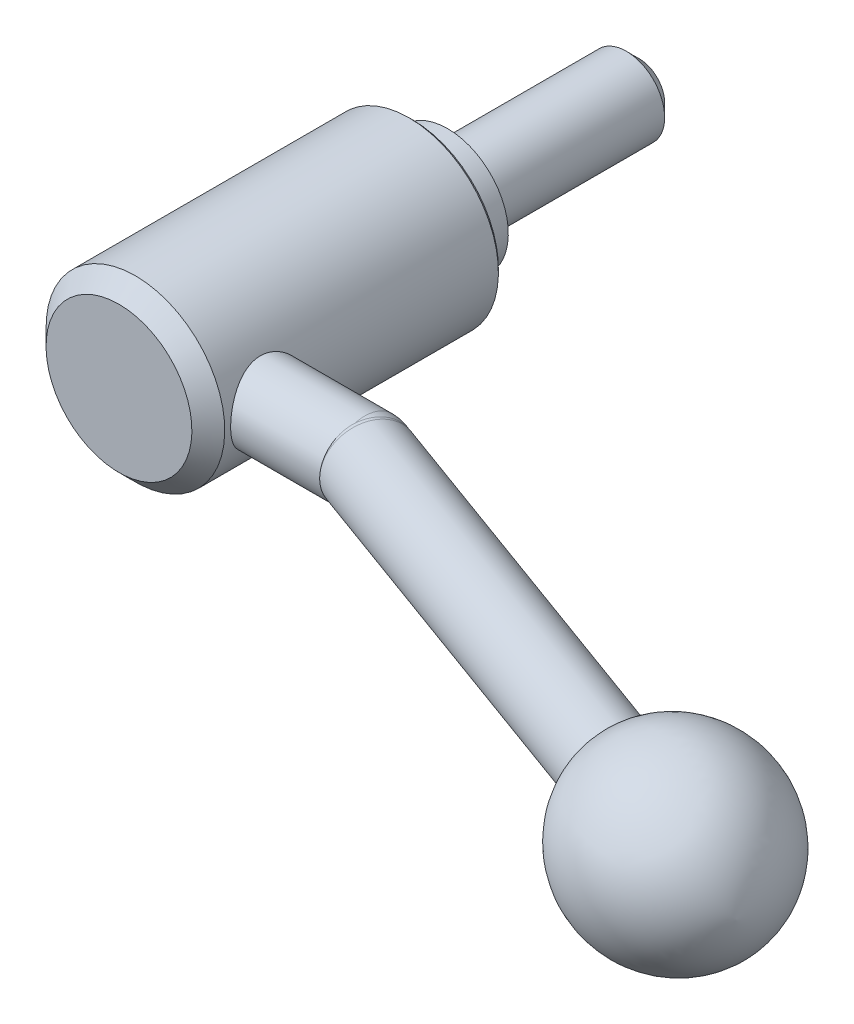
ISO-10303-21;
HEADER;
FILE_DESCRIPTION(('STEP AP214'),'2;1');
FILE_NAME('part.step','',(''),(''),'','','');
FILE_SCHEMA(('AUTOMOTIVE_DESIGN { 1 0 10303 214 1 1 1 1 }'));
ENDSEC;
DATA;
#1=APPLICATION_CONTEXT('core data for automotive mechanical design processes');
#2=APPLICATION_PROTOCOL_DEFINITION('international standard','automotive_design',2000,#1);
#3=PRODUCT_CONTEXT('',#1,'mechanical');
#4=PRODUCT('Part','Part','',(#3));
#5=PRODUCT_RELATED_PRODUCT_CATEGORY('part','',(#4));
#6=PRODUCT_DEFINITION_FORMATION('','',#4);
#7=PRODUCT_DEFINITION_CONTEXT('part definition',#1,'design');
#8=PRODUCT_DEFINITION('design','',#6,#7);
#9=PRODUCT_DEFINITION_SHAPE('','',#8);
#10=(LENGTH_UNIT() NAMED_UNIT(*) SI_UNIT(.MILLI.,.METRE.));
#11=(NAMED_UNIT(*) PLANE_ANGLE_UNIT() SI_UNIT($,.RADIAN.));
#12=(NAMED_UNIT(*) SI_UNIT($,.STERADIAN.) SOLID_ANGLE_UNIT());
#13=UNCERTAINTY_MEASURE_WITH_UNIT(LENGTH_MEASURE(1.E-05),#10,'distance_accuracy_value','');
#14=(GEOMETRIC_REPRESENTATION_CONTEXT(3) GLOBAL_UNCERTAINTY_ASSIGNED_CONTEXT((#13)) GLOBAL_UNIT_ASSIGNED_CONTEXT((#10,
#11,#12)) REPRESENTATION_CONTEXT('',''));
#15=CARTESIAN_POINT('',(0.,0.,0.));
#16=DIRECTION('',(0.,0.,1.));
#17=DIRECTION('',(1.,0.,0.));
#18=AXIS2_PLACEMENT_3D('',#15,#16,#17);
#19=CARTESIAN_POINT('',(0.,0.,0.));
#20=DIRECTION('',(0.,0.,-1.));
#21=DIRECTION('',(0.,1.,0.));
#22=AXIS2_PLACEMENT_3D('',#19,#20,#21);
#23=CYLINDRICAL_SURFACE('',#22,14.);
#24=CARTESIAN_POINT('',(0.,0.,6.05));
#25=DIRECTION('',(0.,0.,-1.));
#26=DIRECTION('',(0.,1.,0.));
#27=AXIS2_PLACEMENT_3D('',#24,#25,#26);
#28=CIRCLE('',#27,14.);
#29=CARTESIAN_POINT('',(0.,14.,6.05));
#30=VERTEX_POINT('',#29);
#31=EDGE_CURVE('E147',#30,#30,#28,.T.);
#32=ORIENTED_EDGE('',*,*,#31,.F.);
#33=EDGE_LOOP('',(#32));
#34=FACE_BOUND('',#33,.T.);
#35=CARTESIAN_POINT('',(12.6491106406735,6.,42.));
#36=CARTESIAN_POINT('',(12.6491119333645,5.99999879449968,42.1596004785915));
#37=CARTESIAN_POINT('',(12.6521417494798,5.99362272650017,42.319252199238));
#38=CARTESIAN_POINT('',(12.6641604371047,5.96818497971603,42.6373858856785));
#39=CARTESIAN_POINT('',(12.6731530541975,5.9491153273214,42.7958670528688));
#40=CARTESIAN_POINT('',(12.6968113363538,5.89845433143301,43.1107250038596));
#41=CARTESIAN_POINT('',(12.7114886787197,5.86683721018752,43.2670967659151));
#42=CARTESIAN_POINT('',(12.7460281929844,5.79141457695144,43.5763457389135));
#43=CARTESIAN_POINT('',(12.7658925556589,5.74760391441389,43.7292214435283));
#44=CARTESIAN_POINT('',(12.8100655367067,5.64846416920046,44.029718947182));
#45=CARTESIAN_POINT('',(12.834352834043,5.59319017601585,44.177362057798));
#46=CARTESIAN_POINT('',(12.8867070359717,5.47148691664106,44.467303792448));
#47=CARTESIAN_POINT('',(12.9147753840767,5.40505338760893,44.6096003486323));
#48=CARTESIAN_POINT('',(13.0034453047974,5.18984372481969,45.0271066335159));
#49=CARTESIAN_POINT('',(13.0685687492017,5.02503655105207,45.2932994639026));
#50=CARTESIAN_POINT('',(13.2082270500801,4.64606142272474,45.8109410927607));
#51=CARTESIAN_POINT('',(13.2830918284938,4.42953098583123,46.0605561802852));
#52=CARTESIAN_POINT('',(13.4311425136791,3.95794082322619,46.5214200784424));
#53=CARTESIAN_POINT('',(13.5043277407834,3.70286580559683,46.7326535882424));
#54=CARTESIAN_POINT('',(13.6088499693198,3.28949768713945,47.0208851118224));
#55=CARTESIAN_POINT('',(13.6435186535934,3.14296205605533,47.11390422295));
#56=CARTESIAN_POINT('',(13.7094062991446,2.84181000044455,47.2871776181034));
#57=CARTESIAN_POINT('',(13.7406265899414,2.68719672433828,47.3674368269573));
#58=CARTESIAN_POINT('',(13.798716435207,2.37092404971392,47.5144478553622));
#59=CARTESIAN_POINT('',(13.8255866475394,2.2092657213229,47.5812017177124));
#60=CARTESIAN_POINT('',(13.8741880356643,1.88004748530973,47.7005320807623));
#61=CARTESIAN_POINT('',(13.895919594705,1.71248801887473,47.7531096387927));
#62=CARTESIAN_POINT('',(13.9325503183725,1.38207962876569,47.8410157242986));
#63=CARTESIAN_POINT('',(13.9477579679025,1.21947370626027,47.8771298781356));
#64=CARTESIAN_POINT('',(13.9725603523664,0.891408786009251,47.9357518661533));
#65=CARTESIAN_POINT('',(13.9821554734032,0.725949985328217,47.9582606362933));
#66=CARTESIAN_POINT('',(13.9954554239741,0.393553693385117,47.9894048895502));
#67=CARTESIAN_POINT('',(13.9991623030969,0.226616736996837,47.9980452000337));
#68=CARTESIAN_POINT('',(14.0005839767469,-0.107418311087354,48.0013627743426));
#69=CARTESIAN_POINT('',(13.9982990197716,-0.274516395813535,47.996040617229));
#70=CARTESIAN_POINT('',(13.9881447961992,-0.596733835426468,47.9722942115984));
#71=CARTESIAN_POINT('',(13.9806457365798,-0.751929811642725,47.9547383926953));
#72=CARTESIAN_POINT('',(13.9606520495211,-1.06021754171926,47.9076442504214));
#73=CARTESIAN_POINT('',(13.9481558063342,-1.21330859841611,47.8781020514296));
#74=CARTESIAN_POINT('',(13.9184825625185,-1.51624558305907,47.807339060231));
#75=CARTESIAN_POINT('',(13.9013071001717,-1.66609256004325,47.7661221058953));
#76=CARTESIAN_POINT('',(13.8626834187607,-1.96169333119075,47.6723729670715));
#77=CARTESIAN_POINT('',(13.8412335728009,-2.10744554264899,47.6198364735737));
#78=CARTESIAN_POINT('',(13.7942200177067,-2.39607632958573,47.5030361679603));
#79=CARTESIAN_POINT('',(13.7685998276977,-2.53887984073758,47.4386094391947));
#80=CARTESIAN_POINT('',(13.7140859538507,-2.81854325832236,47.2990820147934));
#81=CARTESIAN_POINT('',(13.6851910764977,-2.9554009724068,47.2239774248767));
#82=CARTESIAN_POINT('',(13.5945766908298,-3.35592063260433,46.9834369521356));
#83=CARTESIAN_POINT('',(13.5288965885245,-3.60971063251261,46.8027004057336));
#84=CARTESIAN_POINT('',(13.3878711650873,-4.10313412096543,46.3903719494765));
#85=CARTESIAN_POINT('',(13.3121702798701,-4.34033236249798,46.1560074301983));
#86=CARTESIAN_POINT('',(13.1631451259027,-4.77326595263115,45.6505491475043));
#87=CARTESIAN_POINT('',(13.0898218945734,-4.96898340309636,45.3794396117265));
#88=CARTESIAN_POINT('',(12.9865629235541,-5.2305288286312,44.9447706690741));
#89=CARTESIAN_POINT('',(12.9527260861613,-5.31354333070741,44.7922272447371));
#90=CARTESIAN_POINT('',(12.8890027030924,-5.46630143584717,44.4798640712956));
#91=CARTESIAN_POINT('',(12.8591145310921,-5.53605050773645,44.3200473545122));
#92=CARTESIAN_POINT('',(12.8043472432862,-5.66157110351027,43.9942625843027));
#93=CARTESIAN_POINT('',(12.7794661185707,-5.7173482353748,43.8282970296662));
#94=CARTESIAN_POINT('',(12.7356345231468,-5.81433157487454,43.4913958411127));
#95=CARTESIAN_POINT('',(12.7166834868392,-5.85553917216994,43.3204606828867));
#96=CARTESIAN_POINT('',(12.6865220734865,-5.9205872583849,42.9866991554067));
#97=CARTESIAN_POINT('',(12.6748757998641,-5.94541170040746,42.824103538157));
#98=CARTESIAN_POINT('',(12.6578221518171,-5.98163380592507,42.4971025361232));
#99=CARTESIAN_POINT('',(12.6524143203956,-5.99303245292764,42.3326972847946));
#100=CARTESIAN_POINT('',(12.6480404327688,-6.00225784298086,42.0034733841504));
#101=CARTESIAN_POINT('',(12.6490723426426,-6.00008887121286,41.8386548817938));
#102=CARTESIAN_POINT('',(12.6575345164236,-5.98221680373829,41.5099230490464));
#103=CARTESIAN_POINT('',(12.6649645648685,-5.96651416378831,41.3460096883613));
#104=CARTESIAN_POINT('',(12.685211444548,-5.92333782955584,41.0317850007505));
#105=CARTESIAN_POINT('',(12.6976163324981,-5.89676170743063,40.8813224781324));
#106=CARTESIAN_POINT('',(12.7273370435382,-5.83233654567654,40.5832773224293));
#107=CARTESIAN_POINT('',(12.7446544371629,-5.79448390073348,40.435695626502));
#108=CARTESIAN_POINT('',(12.7836779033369,-5.70787446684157,40.1443991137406));
#109=CARTESIAN_POINT('',(12.8053831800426,-5.65911965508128,40.0006836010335));
#110=CARTESIAN_POINT('',(12.8525781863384,-5.55109972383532,39.7178468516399));
#111=CARTESIAN_POINT('',(12.8780693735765,-5.49183055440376,39.5787274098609));
#112=CARTESIAN_POINT('',(12.9333207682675,-5.36045709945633,39.2999549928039));
#113=CARTESIAN_POINT('',(12.9632176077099,-5.28790975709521,39.160537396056));
#114=CARTESIAN_POINT('',(13.0255703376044,-5.13240219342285,38.8882359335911));
#115=CARTESIAN_POINT('',(13.0580270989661,-5.04943842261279,38.7553543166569));
#116=CARTESIAN_POINT('',(13.1580121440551,-4.78560208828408,38.3674196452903));
#117=CARTESIAN_POINT('',(13.2281845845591,-4.58971750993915,38.1229353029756));
#118=CARTESIAN_POINT('',(13.3366249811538,-4.26021445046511,37.7715869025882));
#119=CARTESIAN_POINT('',(13.3748529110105,-4.13892354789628,37.6527973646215));
#120=CARTESIAN_POINT('',(13.4503551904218,-3.88654904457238,37.4257795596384));
#121=CARTESIAN_POINT('',(13.4876298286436,-3.75546845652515,37.3175480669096));
#122=CARTESIAN_POINT('',(13.5602429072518,-3.48418488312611,37.1123202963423));
#123=CARTESIAN_POINT('',(13.5955803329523,-3.34397719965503,37.0153298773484));
#124=CARTESIAN_POINT('',(13.6633349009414,-3.05536185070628,36.8333913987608));
#125=CARTESIAN_POINT('',(13.6957533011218,-2.90695776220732,36.7484381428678));
#126=CARTESIAN_POINT('',(13.7569620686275,-2.60198219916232,36.5908122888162));
#127=CARTESIAN_POINT('',(13.78573175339,-2.44537070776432,36.5182089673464));
#128=CARTESIAN_POINT('',(13.8386034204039,-2.12585519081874,36.3865716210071));
#129=CARTESIAN_POINT('',(13.862707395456,-1.96295388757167,36.3275318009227));
#130=CARTESIAN_POINT('',(13.9055467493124,-1.63205123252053,36.2236281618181));
#131=CARTESIAN_POINT('',(13.9242837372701,-1.46405142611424,36.1787600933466));
#132=CARTESIAN_POINT('',(13.9558282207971,-1.12426022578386,36.1037042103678));
#133=CARTESIAN_POINT('',(13.9686361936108,-0.952469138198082,36.0735152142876));
#134=CARTESIAN_POINT('',(13.9872197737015,-0.619242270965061,36.0298514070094));
#135=CARTESIAN_POINT('',(13.9934418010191,-0.457969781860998,36.0153142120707));
#136=CARTESIAN_POINT('',(14.0002858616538,-0.134661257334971,35.9993285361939));
#137=CARTESIAN_POINT('',(14.0009081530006,0.0273747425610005,35.99787945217));
#138=CARTESIAN_POINT('',(13.9965361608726,0.350926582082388,36.008085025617));
#139=CARTESIAN_POINT('',(13.991542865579,0.512442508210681,36.0197373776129));
#140=CARTESIAN_POINT('',(13.976077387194,0.833743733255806,36.0560107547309));
#141=CARTESIAN_POINT('',(13.9656052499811,0.993529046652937,36.0806316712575));
#142=CARTESIAN_POINT('',(13.9399800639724,1.30393627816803,36.1413509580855));
#143=CARTESIAN_POINT('',(13.9250277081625,1.45467118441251,36.176958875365));
#144=CARTESIAN_POINT('',(13.89068609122,1.75251852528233,36.2595669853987));
#145=CARTESIAN_POINT('',(13.8712953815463,1.89962975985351,36.3065708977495));
#146=CARTESIAN_POINT('',(13.8285434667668,2.18924878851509,36.4115377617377));
#147=CARTESIAN_POINT('',(13.8051831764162,2.33175763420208,36.4694981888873));
#148=CARTESIAN_POINT('',(13.7550167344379,2.61145800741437,36.5959410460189));
#149=CARTESIAN_POINT('',(13.7282092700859,2.74864748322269,36.6644274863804));
#150=CARTESIAN_POINT('',(13.6704759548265,3.02301487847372,36.8147378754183));
#151=CARTESIAN_POINT('',(13.639418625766,3.1599112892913,36.8970251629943));
#152=CARTESIAN_POINT('',(13.5749315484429,3.42637329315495,37.0719801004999));
#153=CARTESIAN_POINT('',(13.5415009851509,3.55593634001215,37.1646513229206));
#154=CARTESIAN_POINT('',(13.4730570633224,3.80705581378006,37.3597829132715));
#155=CARTESIAN_POINT('',(13.4380434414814,3.9286109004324,37.4622449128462));
#156=CARTESIAN_POINT('',(13.3672591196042,4.16309810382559,37.6763643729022));
#157=CARTESIAN_POINT('',(13.3314883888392,4.27602986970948,37.7880222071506));
#158=CARTESIAN_POINT('',(13.257431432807,4.50061025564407,38.02841367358));
#159=CARTESIAN_POINT('',(13.2191519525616,4.61156500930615,38.1577987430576));
#160=CARTESIAN_POINT('',(13.1437838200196,4.82218384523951,38.4257073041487));
#161=CARTESIAN_POINT('',(13.1066947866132,4.92185156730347,38.5642278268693));
#162=CARTESIAN_POINT('',(13.0347422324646,5.10936324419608,38.8498227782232));
#163=CARTESIAN_POINT('',(12.9998810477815,5.19719489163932,38.9969058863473));
#164=CARTESIAN_POINT('',(12.9335248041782,5.36019403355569,39.2985749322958));
#165=CARTESIAN_POINT('',(12.9020282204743,5.43536727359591,39.4531574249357));
#166=CARTESIAN_POINT('',(12.8434648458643,5.57233851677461,39.7687244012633));
#167=CARTESIAN_POINT('',(12.8163926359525,5.63415291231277,39.9297007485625));
#168=CARTESIAN_POINT('',(12.7676047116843,5.74385568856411,40.2570433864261));
#169=CARTESIAN_POINT('',(12.7458863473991,5.79175096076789,40.4234069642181));
#170=CARTESIAN_POINT('',(12.7086612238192,5.87298255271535,40.7598587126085));
#171=CARTESIAN_POINT('',(12.6931381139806,5.90635721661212,40.9299358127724));
#172=CARTESIAN_POINT('',(12.6688496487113,5.95827833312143,41.2727263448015));
#173=CARTESIAN_POINT('',(12.6600791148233,5.97683614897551,41.4454376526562));
#174=CARTESIAN_POINT('',(12.6529445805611,5.99191158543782,41.6821226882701));
#175=CARTESIAN_POINT('',(12.6515079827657,5.99494373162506,41.7456483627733));
#176=CARTESIAN_POINT('',(12.6495907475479,5.998988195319,41.8727799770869));
#177=CARTESIAN_POINT('',(12.6491101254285,6.00000048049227,41.936385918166));
#178=CARTESIAN_POINT('',(12.6491106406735,6.,42.));
#179=B_SPLINE_CURVE_WITH_KNOTS('',3,(#35,#36,#37,#38,#39,#40,#41,#42,#43,#44,#45,#46,#47,#48,
#49,#50,#51,#52,#53,#54,#55,#56,#57,#58,#59,#60,#61,#62,#63,#64,#65,#66,#67,#68,#69,#70,#71,#72,
#73,#74,#75,#76,#77,#78,#79,#80,#81,#82,#83,#84,#85,#86,#87,#88,#89,#90,#91,#92,#93,#94,#95,#96,
#97,#98,#99,#100,#101,#102,#103,#104,#105,#106,#107,#108,#109,#110,#111,#112,#113,#114,#115,
#116,#117,#118,#119,#120,#121,#122,#123,#124,#125,#126,#127,#128,#129,#130,#131,#132,#133,#134,
#135,#136,#137,#138,#139,#140,#141,#142,#143,#144,#145,#146,#147,#148,#149,#150,#151,#152,#153,
#154,#155,#156,#157,#158,#159,#160,#161,#162,#163,#164,#165,#166,#167,#168,#169,#170,#171,#172,
#173,#174,#175,#176,#177,#178),.UNSPECIFIED.,.T.,.F.,(4,2,2,2,2,2,2,2,2,2,2,2,2,2,2,2,2,2,2,2,2,
2,2,2,2,2,2,2,2,2,2,2,2,2,2,2,2,2,2,2,2,2,2,2,2,2,2,2,2,2,2,2,2,2,2,2,2,2,2,2,2,2,2,2,2,2,2,2,2,
2,2,4),(0.,0.478735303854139,0.957771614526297,1.43779720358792,1.91802586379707,
2.39599804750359,2.87415322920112,3.82930565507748,4.84157827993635,5.85425356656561,
6.38467511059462,6.91489143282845,7.44502749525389,7.97512400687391,8.47625092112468,
8.9773433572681,9.47826133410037,9.97915853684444,10.4477041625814,10.9164014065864,
11.3849447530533,11.8536667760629,12.3293655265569,12.8052382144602,13.756394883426,
14.7778987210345,15.7998424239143,16.330075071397,16.8600886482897,17.3898891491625,
17.9196391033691,18.4136567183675,18.9076381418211,19.4014635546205,19.8952723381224,
20.354632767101,20.814140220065,21.2735644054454,21.7331659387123,22.2125740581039,
22.6921459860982,23.6508169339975,24.1724207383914,24.6938646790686,25.2155791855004,
25.7370677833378,26.2613915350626,26.7854908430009,27.3094328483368,27.8333326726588,
28.3188546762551,28.8043543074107,29.2897685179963,29.7751786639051,30.2414628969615,
30.7078995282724,31.1742288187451,31.6407362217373,32.1283561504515,32.6161443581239,
33.1040139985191,33.5919034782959,34.1153644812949,34.6386561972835,35.1624879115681,
35.6860812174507,36.2090283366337,36.7317160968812,37.253015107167,37.7739139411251,
37.9647267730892,38.1555426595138),.UNSPECIFIED.);
#180=CARTESIAN_POINT('',(12.6491106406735,6.,42.));
#181=VERTEX_POINT('',#180);
#182=EDGE_CURVE('E77',#181,#181,#179,.T.);
#183=ORIENTED_EDGE('',*,*,#182,.F.);
#184=EDGE_LOOP('',(#183));
#185=FACE_BOUND('',#184,.T.);
#186=CARTESIAN_POINT('',(0.,0.,48.925));
#187=DIRECTION('',(0.,0.,-1.));
#188=DIRECTION('',(0.,1.,0.));
#189=AXIS2_PLACEMENT_3D('',#186,#187,#188);
#190=CIRCLE('',#189,14.);
#191=CARTESIAN_POINT('',(0.,14.,48.925));
#192=VERTEX_POINT('',#191);
#193=EDGE_CURVE('E149',#192,#192,#190,.T.);
#194=ORIENTED_EDGE('',*,*,#193,.T.);
#195=EDGE_LOOP('',(#194));
#196=FACE_BOUND('',#195,.T.);
#197=ADVANCED_FACE('F14',(#34,#185,#196),#23,.T.);
#198=CARTESIAN_POINT('',(0.,0.,51.5));
#199=DIRECTION('',(0.,0.,-1.));
#200=DIRECTION('',(0.,1.,0.));
#201=AXIS2_PLACEMENT_3D('',#198,#199,#200);
#202=PLANE('',#201);
#203=CARTESIAN_POINT('',(0.,0.,51.5));
#204=DIRECTION('',(0.,0.,-1.));
#205=DIRECTION('',(0.,1.,0.));
#206=AXIS2_PLACEMENT_3D('',#203,#204,#205);
#207=CIRCLE('',#206,11.425);
#208=CARTESIAN_POINT('',(0.,11.425,51.5));
#209=VERTEX_POINT('',#208);
#210=EDGE_CURVE('E85',#209,#209,#207,.T.);
#211=ORIENTED_EDGE('',*,*,#210,.F.);
#212=EDGE_LOOP('',(#211));
#213=FACE_BOUND('',#212,.T.);
#214=ADVANCED_FACE('F61',(#213),#202,.F.);
#215=CARTESIAN_POINT('',(0.,0.,51.5));
#216=DIRECTION('',(0.,0.,-1.));
#217=DIRECTION('',(0.,1.,0.));
#218=AXIS2_PLACEMENT_3D('',#215,#216,#217);
#219=CONICAL_SURFACE('',#218,11.425,0.785398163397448);
#220=ORIENTED_EDGE('',*,*,#193,.F.);
#221=EDGE_LOOP('',(#220));
#222=FACE_BOUND('',#221,.T.);
#223=ORIENTED_EDGE('',*,*,#210,.T.);
#224=EDGE_LOOP('',(#223));
#225=FACE_BOUND('',#224,.T.);
#226=ADVANCED_FACE('F67',(#222,#225),#219,.T.);
#227=CARTESIAN_POINT('',(0.,0.,6.05));
#228=DIRECTION('',(0.,0.,1.));
#229=DIRECTION('',(0.,-1.,0.));
#230=AXIS2_PLACEMENT_3D('',#227,#228,#229);
#231=CONICAL_SURFACE('',#230,14.,0.785398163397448);
#232=CARTESIAN_POINT('',(0.,0.,5.5));
#233=DIRECTION('',(0.,0.,-1.));
#234=DIRECTION('',(0.,1.,0.));
#235=AXIS2_PLACEMENT_3D('',#232,#233,#234);
#236=CIRCLE('',#235,13.45);
#237=CARTESIAN_POINT('',(0.,13.45,5.5));
#238=VERTEX_POINT('',#237);
#239=EDGE_CURVE('E142',#238,#238,#236,.T.);
#240=ORIENTED_EDGE('',*,*,#239,.F.);
#241=EDGE_LOOP('',(#240));
#242=FACE_BOUND('',#241,.T.);
#243=ORIENTED_EDGE('',*,*,#31,.T.);
#244=EDGE_LOOP('',(#243));
#245=FACE_BOUND('',#244,.T.);
#246=ADVANCED_FACE('F74',(#242,#245),#231,.T.);
#247=CARTESIAN_POINT('',(13.45,0.,5.5));
#248=DIRECTION('',(0.,0.,1.));
#249=DIRECTION('',(0.,-1.,0.));
#250=AXIS2_PLACEMENT_3D('',#247,#248,#249);
#251=PLANE('',#250);
#252=CARTESIAN_POINT('',(0.,0.,5.5));
#253=DIRECTION('',(0.,0.,-1.));
#254=DIRECTION('',(0.,1.,0.));
#255=AXIS2_PLACEMENT_3D('',#252,#253,#254);
#256=CIRCLE('',#255,9.5);
#257=CARTESIAN_POINT('',(0.,9.5,5.5));
#258=VERTEX_POINT('',#257);
#259=EDGE_CURVE('E140',#258,#258,#256,.T.);
#260=ORIENTED_EDGE('',*,*,#259,.F.);
#261=EDGE_LOOP('',(#260));
#262=FACE_BOUND('',#261,.T.);
#263=ORIENTED_EDGE('',*,*,#239,.T.);
#264=EDGE_LOOP('',(#263));
#265=FACE_BOUND('',#264,.T.);
#266=ADVANCED_FACE('F161',(#262,#265),#251,.F.);
#267=CARTESIAN_POINT('',(0.,0.,0.));
#268=DIRECTION('',(0.,0.,-1.));
#269=DIRECTION('',(0.,1.,0.));
#270=AXIS2_PLACEMENT_3D('',#267,#268,#269);
#271=CYLINDRICAL_SURFACE('',#270,9.5);
#272=CARTESIAN_POINT('',(0.,0.,0.));
#273=DIRECTION('',(0.,0.,-1.));
#274=DIRECTION('',(0.,1.,0.));
#275=AXIS2_PLACEMENT_3D('',#272,#273,#274);
#276=CIRCLE('',#275,9.5);
#277=CARTESIAN_POINT('',(0.,9.5,0.));
#278=VERTEX_POINT('',#277);
#279=EDGE_CURVE('E138',#278,#278,#276,.T.);
#280=ORIENTED_EDGE('',*,*,#279,.F.);
#281=EDGE_LOOP('',(#280));
#282=FACE_BOUND('',#281,.T.);
#283=ORIENTED_EDGE('',*,*,#259,.T.);
#284=EDGE_LOOP('',(#283));
#285=FACE_BOUND('',#284,.T.);
#286=ADVANCED_FACE('F135',(#282,#285),#271,.T.);
#287=CARTESIAN_POINT('',(9.5,0.,0.));
#288=DIRECTION('',(0.,0.,1.));
#289=DIRECTION('',(0.,-1.,0.));
#290=AXIS2_PLACEMENT_3D('',#287,#288,#289);
#291=PLANE('',#290);
#292=CARTESIAN_POINT('',(0.,0.,0.));
#293=DIRECTION('',(0.,0.,-1.));
#294=DIRECTION('',(0.,1.,0.));
#295=AXIS2_PLACEMENT_3D('',#292,#293,#294);
#296=CIRCLE('',#295,6.);
#297=CARTESIAN_POINT('',(0.,6.,0.));
#298=VERTEX_POINT('',#297);
#299=EDGE_CURVE('E126',#298,#298,#296,.T.);
#300=ORIENTED_EDGE('',*,*,#299,.F.);
#301=EDGE_LOOP('',(#300));
#302=FACE_BOUND('',#301,.T.);
#303=ORIENTED_EDGE('',*,*,#279,.T.);
#304=EDGE_LOOP('',(#303));
#305=FACE_BOUND('',#304,.T.);
#306=ADVANCED_FACE('F93',(#302,#305),#291,.F.);
#307=CARTESIAN_POINT('',(35.,0.,42.));
#308=DIRECTION('',(1.,0.,0.));
#309=DIRECTION('',(0.,1.,0.));
#310=AXIS2_PLACEMENT_3D('',#307,#308,#309);
#311=CYLINDRICAL_SURFACE('',#310,6.);
#312=CARTESIAN_POINT('',(29.0002,-5.79737991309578,43.546087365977));
#313=CARTESIAN_POINT('',(28.9724990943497,-5.77707543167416,43.6222362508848));
#314=CARTESIAN_POINT('',(28.9459271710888,-5.75516638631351,43.6983487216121));
#315=CARTESIAN_POINT('',(28.894739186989,-5.70814835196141,43.8502306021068));
#316=CARTESIAN_POINT('',(28.8701228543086,-5.68303980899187,43.9260000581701));
#317=CARTESIAN_POINT('',(28.7987695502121,-5.6029491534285,44.1523368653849));
#318=CARTESIAN_POINT('',(28.7544982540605,-5.54317949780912,44.3020176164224));
#319=CARTESIAN_POINT('',(28.6711793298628,-5.41121602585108,44.5970862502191));
#320=CARTESIAN_POINT('',(28.6321268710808,-5.3390338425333,44.7424780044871));
#321=CARTESIAN_POINT('',(28.5583361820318,-5.18257721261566,45.0277646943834));
#322=CARTESIAN_POINT('',(28.5235982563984,-5.09830191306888,45.1676592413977));
#323=CARTESIAN_POINT('',(28.4579073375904,-4.91822874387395,45.4406017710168));
#324=CARTESIAN_POINT('',(28.4269515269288,-4.82243955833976,45.5736548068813));
#325=CARTESIAN_POINT('',(28.3684157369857,-4.61988344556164,45.8319198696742));
#326=CARTESIAN_POINT('',(28.3408357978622,-4.5131163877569,45.9571318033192));
#327=CARTESIAN_POINT('',(28.2887910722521,-4.28931411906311,46.1986769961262));
#328=CARTESIAN_POINT('',(28.264325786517,-4.17228055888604,46.3150116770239));
#329=CARTESIAN_POINT('',(28.2183149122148,-3.92870690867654,46.537897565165));
#330=CARTESIAN_POINT('',(28.1967693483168,-3.8021667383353,46.6444486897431));
#331=CARTESIAN_POINT('',(28.1562496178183,-3.53907309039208,46.8479799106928));
#332=CARTESIAN_POINT('',(28.1373045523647,-3.40242909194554,46.944848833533));
#333=CARTESIAN_POINT('',(28.1021430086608,-3.12121919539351,47.1269937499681));
#334=CARTESIAN_POINT('',(28.0859274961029,-2.97665051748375,47.212265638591));
#335=CARTESIAN_POINT('',(28.0561585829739,-2.68068805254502,47.3704807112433));
#336=CARTESIAN_POINT('',(28.0426047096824,-2.52929548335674,47.4434260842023));
#337=CARTESIAN_POINT('',(28.0180943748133,-2.2206886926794,47.5764491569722));
#338=CARTESIAN_POINT('',(28.0071388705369,-2.063472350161,47.6365221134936));
#339=CARTESIAN_POINT('',(27.987872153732,-1.74574860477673,47.7428380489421));
#340=CARTESIAN_POINT('',(27.97953948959,-1.5852799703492,47.7891930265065));
#341=CARTESIAN_POINT('',(27.965363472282,-1.26087148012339,47.8683977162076));
#342=CARTESIAN_POINT('',(27.9595210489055,-1.09693035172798,47.9012423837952));
#343=CARTESIAN_POINT('',(27.950314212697,-0.766902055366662,47.9531293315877));
#344=CARTESIAN_POINT('',(27.9469484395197,-0.600816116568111,47.972179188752));
#345=CARTESIAN_POINT('',(27.9426785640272,-0.267526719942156,47.9963621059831));
#346=CARTESIAN_POINT('',(27.9417755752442,-0.100322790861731,48.0014888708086));
#347=CARTESIAN_POINT('',(27.9424301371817,0.233076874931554,47.9977768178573));
#348=CARTESIAN_POINT('',(27.943975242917,0.399273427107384,47.9890086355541));
#349=CARTESIAN_POINT('',(27.9495060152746,0.730248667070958,47.9577139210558));
#350=CARTESIAN_POINT('',(27.9534905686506,0.895027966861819,47.9351936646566));
#351=CARTESIAN_POINT('',(27.9639138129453,1.22215531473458,47.8765604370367));
#352=CARTESIAN_POINT('',(27.9703537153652,1.38450212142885,47.8404407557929));
#353=CARTESIAN_POINT('',(27.9857050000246,1.70547020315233,47.7549062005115));
#354=CARTESIAN_POINT('',(27.9946154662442,1.86409283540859,47.7054962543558));
#355=CARTESIAN_POINT('',(28.0149428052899,2.17661167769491,47.5937385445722));
#356=CARTESIAN_POINT('',(28.0263605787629,2.33050616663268,47.5313861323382));
#357=CARTESIAN_POINT('',(28.0517386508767,2.63237333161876,47.3942638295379));
#358=CARTESIAN_POINT('',(28.0656980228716,2.78034814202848,47.3194984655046));
#359=CARTESIAN_POINT('',(28.0962237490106,3.06943625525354,47.1580977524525));
#360=CARTESIAN_POINT('',(28.1127906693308,3.21054805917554,47.0714598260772));
#361=CARTESIAN_POINT('',(28.1486024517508,3.48485557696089,46.8870325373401));
#362=CARTESIAN_POINT('',(28.1678464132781,3.61805393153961,46.789246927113));
#363=CARTESIAN_POINT('',(28.2092310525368,3.87634885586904,46.5827287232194));
#364=CARTESIAN_POINT('',(28.2313862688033,4.00139970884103,46.4739418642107));
#365=CARTESIAN_POINT('',(28.2786635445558,4.24179144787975,46.2467117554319));
#366=CARTESIAN_POINT('',(28.303785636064,4.35713222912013,46.128268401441));
#367=CARTESIAN_POINT('',(28.3572036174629,4.57734862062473,45.8826648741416));
#368=CARTESIAN_POINT('',(28.38549985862,4.68222307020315,45.7555037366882));
#369=CARTESIAN_POINT('',(28.445549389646,4.88081288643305,45.4935198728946));
#370=CARTESIAN_POINT('',(28.4773025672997,4.97452861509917,45.3586973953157));
#371=CARTESIAN_POINT('',(28.5429262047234,5.14565563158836,45.0897088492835));
#372=CARTESIAN_POINT('',(28.5766009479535,5.22366104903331,44.9558726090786));
#373=CARTESIAN_POINT('',(28.647938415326,5.36870734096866,44.6834298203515));
#374=CARTESIAN_POINT('',(28.6856006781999,5.43574948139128,44.5448238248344));
#375=CARTESIAN_POINT('',(28.7657142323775,5.55859867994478,44.2639502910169));
#376=CARTESIAN_POINT('',(28.8081677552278,5.61440046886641,44.1216810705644));
#377=CARTESIAN_POINT('',(28.8763731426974,5.68948565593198,43.9067054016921));
#378=CARTESIAN_POINT('',(28.8998696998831,5.7130832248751,43.8347644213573));
#379=CARTESIAN_POINT('',(28.9486375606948,5.7573957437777,43.6905883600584));
#380=CARTESIAN_POINT('',(28.9739090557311,5.77811038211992,43.6183532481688));
#381=CARTESIAN_POINT('',(29.0001999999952,5.79737991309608,43.546087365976));
#382=B_SPLINE_CURVE_WITH_KNOTS('',3,(#312,#313,#314,#315,#316,#317,#318,#319,#320,#321,#322,
#323,#324,#325,#326,#327,#328,#329,#330,#331,#332,#333,#334,#335,#336,#337,#338,#339,#340,#341,
#342,#343,#344,#345,#346,#347,#348,#349,#350,#351,#352,#353,#354,#355,#356,#357,#358,#359,#360,
#361,#362,#363,#364,#365,#366,#367,#368,#369,#370,#371,#372,#373,#374,#375,#376,#377,#378,#379,
#380,#381),.UNSPECIFIED.,.F.,.F.,(4,2,2,2,2,2,2,2,2,2,2,2,2,2,2,2,2,2,2,2,2,2,2,2,2,2,2,2,2,2,2,
2,2,2,4),(0.,0.250554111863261,0.501073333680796,1.00183412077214,1.50212812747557,
2.0024574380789,2.50241172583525,3.00237196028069,3.50225195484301,4.00213617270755,
4.50722386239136,5.01248987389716,5.51766606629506,6.02302808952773,6.52414248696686,
7.02544382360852,7.52646960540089,8.02772188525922,8.52643419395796,9.02491908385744,
9.52365025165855,10.0221967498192,10.5209226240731,11.0194670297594,11.5181198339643,
12.0166052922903,12.5176821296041,13.0187643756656,13.5199021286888,14.0210236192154,
14.4961092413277,14.9711399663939,15.4463928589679,15.684153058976,15.9219389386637),.UNSPECIFIED.);
#383=CARTESIAN_POINT('',(29.,-5.79723335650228,43.5466368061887));
#384=VERTEX_POINT('',#383);
#385=CARTESIAN_POINT('',(27.9420381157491,0.,48.));
#386=VERTEX_POINT('',#385);
#387=EDGE_CURVE('E29',#384,#386,#382,.T.);
#388=ORIENTED_EDGE('',*,*,#387,.T.);
#389=CARTESIAN_POINT('',(29.,5.79723335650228,43.5466368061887));
#390=VERTEX_POINT('',#389);
#391=EDGE_CURVE('E98',#386,#390,#382,.T.);
#392=ORIENTED_EDGE('',*,*,#391,.T.);
#393=CARTESIAN_POINT('',(29.,0.,42.));
#394=DIRECTION('',(1.,0.,0.));
#395=DIRECTION('',(0.,1.,0.));
#396=AXIS2_PLACEMENT_3D('',#393,#394,#395);
#397=CIRCLE('',#396,6.);
#398=EDGE_CURVE('E107',#384,#390,#397,.T.);
#399=ORIENTED_EDGE('',*,*,#398,.F.);
#400=EDGE_LOOP('',(#388,#392,#399));
#401=FACE_BOUND('',#400,.T.);
#402=ORIENTED_EDGE('',*,*,#182,.T.);
#403=EDGE_LOOP('',(#402));
#404=FACE_BOUND('',#403,.T.);
#405=ADVANCED_FACE('F87',(#401,#404),#311,.T.);
#406=CARTESIAN_POINT('',(29.,0.,42.));
#407=DIRECTION('',(1.,0.,0.));
#408=DIRECTION('',(0.,0.,1.));
#409=AXIS2_PLACEMENT_3D('',#406,#407,#408);
#410=SPHERICAL_SURFACE('',#409,6.);
#411=CARTESIAN_POINT('',(29.4970794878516,0.,42.1809221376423));
#412=DIRECTION('',(0.939692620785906,0.,0.342020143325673));
#413=DIRECTION('',(-0.342020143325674,0.,0.939692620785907));
#414=AXIS2_PLACEMENT_3D('',#411,#412,#413);
#415=CIRCLE('',#414,5.97663610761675);
#416=EDGE_CURVE('E36',#384,#390,#415,.T.);
#417=ORIENTED_EDGE('',*,*,#416,.F.);
#418=ORIENTED_EDGE('',*,*,#398,.T.);
#419=EDGE_LOOP('',(#417,#418));
#420=FACE_BOUND('',#419,.T.);
#421=ADVANCED_FACE('F92',(#420),#410,.T.);
#422=CARTESIAN_POINT('',(29.9941589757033,0.,42.3618442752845));
#423=DIRECTION('',(0.939692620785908,0.,0.342020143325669));
#424=DIRECTION('',(-0.342020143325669,0.,0.939692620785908));
#425=AXIS2_PLACEMENT_3D('',#422,#423,#424);
#426=SPHERICAL_SURFACE('',#425,6.);
#427=ORIENTED_EDGE('',*,*,#387,.F.);
#428=ORIENTED_EDGE('',*,*,#416,.T.);
#429=ORIENTED_EDGE('',*,*,#391,.F.);
#430=CARTESIAN_POINT('',(29.9941589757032,0.,42.3618442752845));
#431=DIRECTION('',(0.939692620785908,0.,0.342020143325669));
#432=DIRECTION('',(-0.342020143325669,0.,0.939692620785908));
#433=AXIS2_PLACEMENT_3D('',#430,#431,#432);
#434=CIRCLE('',#433,6.);
#435=EDGE_CURVE('E105',#386,#386,#434,.T.);
#436=ORIENTED_EDGE('',*,*,#435,.F.);
#437=EDGE_LOOP('',(#427,#428,#429,#436));
#438=FACE_BOUND('',#437,.T.);
#439=ADVANCED_FACE('F109',(#438),#426,.T.);
#440=CARTESIAN_POINT('',(120.484247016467,0.,75.2975428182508));
#441=DIRECTION('',(0.939692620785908,0.,0.342020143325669));
#442=DIRECTION('',(-0.342020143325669,0.,0.939692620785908));
#443=AXIS2_PLACEMENT_3D('',#440,#441,#442);
#444=CYLINDRICAL_SURFACE('',#443,6.);
#445=CARTESIAN_POINT('',(93.4815813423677,0.,65.4693762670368));
#446=DIRECTION('',(0.939692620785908,0.,0.342020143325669));
#447=DIRECTION('',(-0.342020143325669,0.,0.939692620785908));
#448=AXIS2_PLACEMENT_3D('',#445,#446,#447);
#449=CIRCLE('',#448,6.);
#450=CARTESIAN_POINT('',(91.4294604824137,0.,71.1075319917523));
#451=VERTEX_POINT('',#450);
#452=EDGE_CURVE('E121',#451,#451,#449,.T.);
#453=ORIENTED_EDGE('',*,*,#452,.F.);
#454=EDGE_LOOP('',(#453));
#455=FACE_BOUND('',#454,.T.);
#456=ORIENTED_EDGE('',*,*,#435,.T.);
#457=EDGE_LOOP('',(#456));
#458=FACE_BOUND('',#457,.T.);
#459=ADVANCED_FACE('F56',(#455,#458),#444,.T.);
#460=CARTESIAN_POINT('',(91.4294604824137,0.,71.1075319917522));
#461=DIRECTION('',(0.939692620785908,0.,0.342020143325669));
#462=DIRECTION('',(-0.342020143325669,0.,0.939692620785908));
#463=AXIS2_PLACEMENT_3D('',#460,#461,#462);
#464=PLANE('',#463);
#465=CARTESIAN_POINT('',(93.4815813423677,0.,65.4693762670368));
#466=DIRECTION('',(0.939692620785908,0.,0.342020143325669));
#467=DIRECTION('',(-0.342020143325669,0.,0.939692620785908));
#468=AXIS2_PLACEMENT_3D('',#465,#466,#467);
#469=CIRCLE('',#468,8.16630341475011);
#470=CARTESIAN_POINT('',(90.688541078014,0.,73.1431913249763));
#471=VERTEX_POINT('',#470);
#472=EDGE_CURVE('E124',#471,#471,#469,.T.);
#473=ORIENTED_EDGE('',*,*,#472,.F.);
#474=EDGE_LOOP('',(#473));
#475=FACE_BOUND('',#474,.T.);
#476=ORIENTED_EDGE('',*,*,#452,.T.);
#477=EDGE_LOOP('',(#476));
#478=FACE_BOUND('',#477,.T.);
#479=ADVANCED_FACE('F45',(#475,#478),#464,.F.);
#480=CARTESIAN_POINT('',(106.,0.,68.5));
#481=DIRECTION('',(0.,0.999999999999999,0.));
#482=DIRECTION('',(-0.342020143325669,0.,0.939692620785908));
#483=AXIS2_PLACEMENT_3D('',#480,#481,#482);
#484=CIRCLE('',#483,16.);
#485=TRIMMED_CURVE('',#484,(PARAMETER_VALUE(-1.48106994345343)),
(PARAMETER_VALUE(1.48106994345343)),.T.,.PARAMETER.);
#486=CARTESIAN_POINT('',(105.509646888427,0.,69.8472341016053));
#487=DIRECTION('',(0.939692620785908,0.,0.342020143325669));
#488=AXIS1_PLACEMENT('',#486,#487);
#489=SURFACE_OF_REVOLUTION('',#485,#488);
#490=ORIENTED_EDGE('',*,*,#472,.T.);
#491=EDGE_LOOP('',(#490));
#492=FACE_BOUND('',#491,.T.);
#493=CARTESIAN_POINT('',(120.484247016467,0.,75.2975428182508));
#494=VERTEX_POINT('',#493);
#495=VERTEX_LOOP('',#494);
#496=FACE_BOUND('',#495,.T.);
#497=ADVANCED_FACE('F42',(#492,#496),#489,.T.);
#498=CARTESIAN_POINT('',(0.,0.,17.));
#499=DIRECTION('',(0.,0.,-1.));
#500=DIRECTION('',(-1.,0.,0.));
#501=AXIS2_PLACEMENT_3D('',#498,#499,#500);
#502=CYLINDRICAL_SURFACE('',#501,6.);
#503=CARTESIAN_POINT('',(0.,0.,-28.));
#504=DIRECTION('',(0.,0.,-1.));
#505=DIRECTION('',(-1.,0.,0.));
#506=AXIS2_PLACEMENT_3D('',#503,#504,#505);
#507=CIRCLE('',#506,6.);
#508=CARTESIAN_POINT('',(-6.,0.,-28.));
#509=VERTEX_POINT('',#508);
#510=EDGE_CURVE('E9',#509,#509,#507,.F.);
#511=ORIENTED_EDGE('',*,*,#510,.T.);
#512=EDGE_LOOP('',(#511));
#513=FACE_BOUND('',#512,.T.);
#514=ORIENTED_EDGE('',*,*,#299,.T.);
#515=EDGE_LOOP('',(#514));
#516=FACE_BOUND('',#515,.T.);
#517=ADVANCED_FACE('F44',(#513,#516),#502,.T.);
#518=CARTESIAN_POINT('',(0.,0.,-30.));
#519=DIRECTION('',(0.,0.,-1.));
#520=DIRECTION('',(-1.,0.,0.));
#521=AXIS2_PLACEMENT_3D('',#518,#519,#520);
#522=PLANE('',#521);
#523=CARTESIAN_POINT('',(0.,0.,-30.));
#524=DIRECTION('',(0.,0.,-1.));
#525=DIRECTION('',(-1.,0.,0.));
#526=AXIS2_PLACEMENT_3D('',#523,#524,#525);
#527=CIRCLE('',#526,4.);
#528=CARTESIAN_POINT('',(-4.,0.,-30.));
#529=VERTEX_POINT('',#528);
#530=EDGE_CURVE('E22',#529,#529,#527,.T.);
#531=ORIENTED_EDGE('',*,*,#530,.T.);
#532=EDGE_LOOP('',(#531));
#533=FACE_BOUND('',#532,.T.);
#534=ADVANCED_FACE('F53',(#533),#522,.T.);
#535=CARTESIAN_POINT('',(0.,0.,-30.));
#536=DIRECTION('',(0.,0.,1.));
#537=DIRECTION('',(1.,0.,0.));
#538=AXIS2_PLACEMENT_3D('',#535,#536,#537);
#539=CONICAL_SURFACE('',#538,4.,0.78539816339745);
#540=ORIENTED_EDGE('',*,*,#510,.F.);
#541=EDGE_LOOP('',(#540));
#542=FACE_BOUND('',#541,.T.);
#543=ORIENTED_EDGE('',*,*,#530,.F.);
#544=EDGE_LOOP('',(#543));
#545=FACE_BOUND('',#544,.T.);
#546=ADVANCED_FACE('F16',(#542,#545),#539,.T.);
#547=CLOSED_SHELL('',(#197,#214,#226,#246,#266,#286,#306,#405,#421,#439,#459,#479,#497,#517,
#534,#546));
#548=MANIFOLD_SOLID_BREP('B1',#547);
#549=ADVANCED_BREP_SHAPE_REPRESENTATION('',(#18,#548),#14);
#550=SHAPE_DEFINITION_REPRESENTATION(#9,#549);
ENDSEC;
END-ISO-10303-21;
